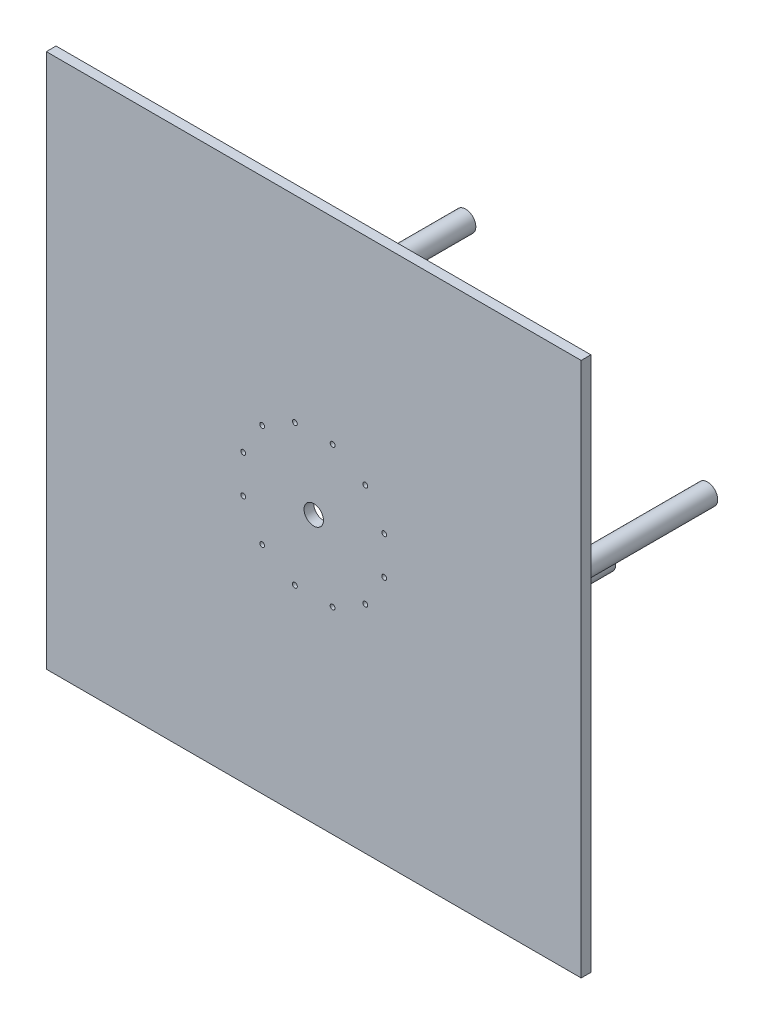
ISO-10303-21;
HEADER;
FILE_DESCRIPTION(('STEP AP214'),'2;1');
FILE_NAME('part.step','',(''),(''),'','','');
FILE_SCHEMA(('AUTOMOTIVE_DESIGN { 1 0 10303 214 1 1 1 1 }'));
ENDSEC;
DATA;
#1=APPLICATION_CONTEXT('core data for automotive mechanical design processes');
#2=APPLICATION_PROTOCOL_DEFINITION('international standard','automotive_design',2000,#1);
#3=PRODUCT_CONTEXT('',#1,'mechanical');
#4=PRODUCT('Part','Part','',(#3));
#5=PRODUCT_RELATED_PRODUCT_CATEGORY('part','',(#4));
#6=PRODUCT_DEFINITION_FORMATION('','',#4);
#7=PRODUCT_DEFINITION_CONTEXT('part definition',#1,'design');
#8=PRODUCT_DEFINITION('design','',#6,#7);
#9=PRODUCT_DEFINITION_SHAPE('','',#8);
#10=(LENGTH_UNIT() NAMED_UNIT(*) SI_UNIT(.MILLI.,.METRE.));
#11=(NAMED_UNIT(*) PLANE_ANGLE_UNIT() SI_UNIT($,.RADIAN.));
#12=(NAMED_UNIT(*) SI_UNIT($,.STERADIAN.) SOLID_ANGLE_UNIT());
#13=UNCERTAINTY_MEASURE_WITH_UNIT(LENGTH_MEASURE(1.E-05),#10,'distance_accuracy_value','');
#14=(GEOMETRIC_REPRESENTATION_CONTEXT(3) GLOBAL_UNCERTAINTY_ASSIGNED_CONTEXT((#13)) GLOBAL_UNIT_ASSIGNED_CONTEXT((#10,
#11,#12)) REPRESENTATION_CONTEXT('',''));
#15=CARTESIAN_POINT('',(0.,0.,0.));
#16=DIRECTION('',(0.,0.,1.));
#17=DIRECTION('',(1.,0.,0.));
#18=AXIS2_PLACEMENT_3D('',#15,#16,#17);
#19=CARTESIAN_POINT('',(0.,1100.,0.));
#20=DIRECTION('',(0.,0.,-1.));
#21=DIRECTION('',(-1.,0.,0.));
#22=AXIS2_PLACEMENT_3D('',#19,#20,#21);
#23=PLANE('',#22);
#24=CARTESIAN_POINT('',(656.066017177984,656.066017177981,0.));
#25=DIRECTION('',(0.,0.,-1.));
#26=DIRECTION('',(-0.866025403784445,-0.499999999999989,0.));
#27=AXIS2_PLACEMENT_3D('',#24,#25,#26);
#28=CIRCLE('',#27,5.00000000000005);
#29=CARTESIAN_POINT('',(651.735890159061,653.566017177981,0.));
#30=VERTEX_POINT('',#29);
#31=EDGE_CURVE('E263',#30,#30,#28,.T.);
#32=ORIENTED_EDGE('',*,*,#31,.F.);
#33=EDGE_LOOP('',(#32));
#34=FACE_BOUND('',#33,.T.);
#35=CARTESIAN_POINT('',(588.82285676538,694.88887394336,0.));
#36=DIRECTION('',(0.,0.,-1.));
#37=DIRECTION('',(-0.50000000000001,-0.866025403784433,0.));
#38=AXIS2_PLACEMENT_3D('',#35,#36,#37);
#39=CIRCLE('',#38,5.00000000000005);
#40=CARTESIAN_POINT('',(586.32285676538,690.558746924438,0.));
#41=VERTEX_POINT('',#40);
#42=EDGE_CURVE('E257',#41,#41,#39,.T.);
#43=ORIENTED_EDGE('',*,*,#42,.F.);
#44=EDGE_LOOP('',(#43));
#45=FACE_BOUND('',#44,.T.);
#46=CARTESIAN_POINT('',(511.177143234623,694.888873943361,0.));
#47=DIRECTION('',(0.,0.,-1.));
#48=DIRECTION('',(0.,-1.,0.));
#49=AXIS2_PLACEMENT_3D('',#46,#47,#48);
#50=CIRCLE('',#49,5.00000000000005);
#51=CARTESIAN_POINT('',(511.177143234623,689.888873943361,0.));
#52=VERTEX_POINT('',#51);
#53=EDGE_CURVE('E251',#52,#52,#50,.T.);
#54=ORIENTED_EDGE('',*,*,#53,.F.);
#55=EDGE_LOOP('',(#54));
#56=FACE_BOUND('',#55,.T.);
#57=CARTESIAN_POINT('',(443.933982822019,656.066017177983,0.));
#58=DIRECTION('',(0.,0.,-1.));
#59=DIRECTION('',(0.499999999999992,-0.866025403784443,0.));
#60=AXIS2_PLACEMENT_3D('',#57,#58,#59);
#61=CIRCLE('',#60,5.00000000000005);
#62=CARTESIAN_POINT('',(446.433982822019,651.735890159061,0.));
#63=VERTEX_POINT('',#62);
#64=EDGE_CURVE('E245',#63,#63,#61,.T.);
#65=ORIENTED_EDGE('',*,*,#64,.F.);
#66=EDGE_LOOP('',(#65));
#67=FACE_BOUND('',#66,.T.);
#68=CARTESIAN_POINT('',(405.11112605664,588.822856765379,0.));
#69=DIRECTION('',(0.,0.,-1.));
#70=DIRECTION('',(0.866025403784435,-0.500000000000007,0.));
#71=AXIS2_PLACEMENT_3D('',#68,#69,#70);
#72=CIRCLE('',#71,5.00000000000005);
#73=CARTESIAN_POINT('',(409.441253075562,586.322856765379,0.));
#74=VERTEX_POINT('',#73);
#75=EDGE_CURVE('E239',#74,#74,#72,.T.);
#76=ORIENTED_EDGE('',*,*,#75,.F.);
#77=EDGE_LOOP('',(#76));
#78=FACE_BOUND('',#77,.T.);
#79=CARTESIAN_POINT('',(405.11112605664,511.177143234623,0.));
#80=DIRECTION('',(0.,0.,-1.));
#81=DIRECTION('',(1.,0.,0.));
#82=AXIS2_PLACEMENT_3D('',#79,#80,#81);
#83=CIRCLE('',#82,5.00000000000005);
#84=CARTESIAN_POINT('',(410.11112605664,511.177143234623,0.));
#85=VERTEX_POINT('',#84);
#86=EDGE_CURVE('E233',#85,#85,#83,.T.);
#87=ORIENTED_EDGE('',*,*,#86,.F.);
#88=EDGE_LOOP('',(#87));
#89=FACE_BOUND('',#88,.T.);
#90=CARTESIAN_POINT('',(443.933982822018,443.933982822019,0.));
#91=DIRECTION('',(0.,0.,-1.));
#92=DIRECTION('',(0.866025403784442,0.499999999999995,0.));
#93=AXIS2_PLACEMENT_3D('',#90,#91,#92);
#94=CIRCLE('',#93,5.00000000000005);
#95=CARTESIAN_POINT('',(448.26410984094,446.433982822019,0.));
#96=VERTEX_POINT('',#95);
#97=EDGE_CURVE('E227',#96,#96,#94,.T.);
#98=ORIENTED_EDGE('',*,*,#97,.F.);
#99=EDGE_LOOP('',(#98));
#100=FACE_BOUND('',#99,.T.);
#101=CARTESIAN_POINT('',(511.177143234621,405.11112605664,0.));
#102=DIRECTION('',(0.,0.,-1.));
#103=DIRECTION('',(0.500000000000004,0.866025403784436,0.));
#104=AXIS2_PLACEMENT_3D('',#101,#102,#103);
#105=CIRCLE('',#104,5.00000000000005);
#106=CARTESIAN_POINT('',(513.677143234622,409.441253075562,0.));
#107=VERTEX_POINT('',#106);
#108=EDGE_CURVE('E221',#107,#107,#105,.T.);
#109=ORIENTED_EDGE('',*,*,#108,.F.);
#110=EDGE_LOOP('',(#109));
#111=FACE_BOUND('',#110,.T.);
#112=CARTESIAN_POINT('',(588.822856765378,405.11112605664,0.));
#113=DIRECTION('',(0.,0.,-1.));
#114=DIRECTION('',(0.,1.,0.));
#115=AXIS2_PLACEMENT_3D('',#112,#113,#114);
#116=CIRCLE('',#115,5.00000000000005);
#117=CARTESIAN_POINT('',(588.822856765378,410.11112605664,0.));
#118=VERTEX_POINT('',#117);
#119=EDGE_CURVE('E215',#118,#118,#116,.T.);
#120=ORIENTED_EDGE('',*,*,#119,.F.);
#121=EDGE_LOOP('',(#120));
#122=FACE_BOUND('',#121,.T.);
#123=CARTESIAN_POINT('',(656.066017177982,443.933982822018,0.));
#124=DIRECTION('',(0.,0.,-1.));
#125=DIRECTION('',(-0.499999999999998,0.86602540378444,0.));
#126=AXIS2_PLACEMENT_3D('',#123,#124,#125);
#127=CIRCLE('',#126,5.00000000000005);
#128=CARTESIAN_POINT('',(653.566017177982,448.26410984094,0.));
#129=VERTEX_POINT('',#128);
#130=EDGE_CURVE('E209',#129,#129,#127,.T.);
#131=ORIENTED_EDGE('',*,*,#130,.F.);
#132=EDGE_LOOP('',(#131));
#133=FACE_BOUND('',#132,.T.);
#134=CARTESIAN_POINT('',(694.88887394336,511.177143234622,0.));
#135=DIRECTION('',(0.,0.,-1.));
#136=DIRECTION('',(-0.866025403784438,0.500000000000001,0.));
#137=AXIS2_PLACEMENT_3D('',#134,#135,#136);
#138=CIRCLE('',#137,5.00000000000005);
#139=CARTESIAN_POINT('',(690.558746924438,513.677143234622,0.));
#140=VERTEX_POINT('',#139);
#141=EDGE_CURVE('E203',#140,#140,#138,.T.);
#142=ORIENTED_EDGE('',*,*,#141,.F.);
#143=EDGE_LOOP('',(#142));
#144=FACE_BOUND('',#143,.T.);
#145=CARTESIAN_POINT('',(694.88887394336,588.822856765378,0.));
#146=DIRECTION('',(0.,0.,-1.));
#147=DIRECTION('',(-1.,0.,0.));
#148=AXIS2_PLACEMENT_3D('',#145,#146,#147);
#149=CIRCLE('',#148,5.00000000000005);
#150=CARTESIAN_POINT('',(689.88887394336,588.822856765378,0.));
#151=VERTEX_POINT('',#150);
#152=EDGE_CURVE('E197',#151,#151,#149,.T.);
#153=ORIENTED_EDGE('',*,*,#152,.F.);
#154=EDGE_LOOP('',(#153));
#155=FACE_BOUND('',#154,.T.);
#156=CARTESIAN_POINT('',(550.,550.,0.));
#157=DIRECTION('',(0.,0.,-1.));
#158=DIRECTION('',(-1.,0.,0.));
#159=AXIS2_PLACEMENT_3D('',#156,#157,#158);
#160=CIRCLE('',#159,20.0000000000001);
#161=CARTESIAN_POINT('',(530.,550.,0.));
#162=VERTEX_POINT('',#161);
#163=EDGE_CURVE('E189',#162,#162,#160,.T.);
#164=ORIENTED_EDGE('',*,*,#163,.F.);
#165=EDGE_LOOP('',(#164));
#166=FACE_BOUND('',#165,.T.);
#167=DIRECTION('',(0.,-1.,0.));
#168=VECTOR('',#167,1.);
#169=CARTESIAN_POINT('',(0.,0.,0.));
#170=LINE('',#169,#168);
#171=CARTESIAN_POINT('',(0.,1100.,0.));
#172=VERTEX_POINT('',#171);
#173=CARTESIAN_POINT('',(0.,0.,0.));
#174=VERTEX_POINT('',#173);
#175=EDGE_CURVE('E70',#172,#174,#170,.T.);
#176=ORIENTED_EDGE('',*,*,#175,.F.);
#177=DIRECTION('',(-1.,0.,0.));
#178=VECTOR('',#177,1.);
#179=CARTESIAN_POINT('',(0.,1100.,0.));
#180=LINE('',#179,#178);
#181=CARTESIAN_POINT('',(1100.,1100.,0.));
#182=VERTEX_POINT('',#181);
#183=EDGE_CURVE('E95',#182,#172,#180,.T.);
#184=ORIENTED_EDGE('',*,*,#183,.F.);
#185=DIRECTION('',(0.,1.,0.));
#186=VECTOR('',#185,1.);
#187=CARTESIAN_POINT('',(1100.,0.,0.));
#188=LINE('',#187,#186);
#189=CARTESIAN_POINT('',(1100.,0.,0.));
#190=VERTEX_POINT('',#189);
#191=EDGE_CURVE('E71',#190,#182,#188,.T.);
#192=ORIENTED_EDGE('',*,*,#191,.F.);
#193=DIRECTION('',(1.,0.,0.));
#194=VECTOR('',#193,1.);
#195=CARTESIAN_POINT('',(0.,0.,0.));
#196=LINE('',#195,#194);
#197=EDGE_CURVE('E65',#174,#190,#196,.T.);
#198=ORIENTED_EDGE('',*,*,#197,.F.);
#199=EDGE_LOOP('',(#176,#184,#192,#198));
#200=FACE_BOUND('',#199,.T.);
#201=CARTESIAN_POINT('',(268.092213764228,652.606042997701,0.));
#202=DIRECTION('',(0.,0.,-1.));
#203=DIRECTION('',(-1.,0.,0.));
#204=AXIS2_PLACEMENT_3D('',#201,#202,#203);
#205=CIRCLE('',#204,21.);
#206=CARTESIAN_POINT('',(247.092213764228,652.606042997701,0.));
#207=VERTEX_POINT('',#206);
#208=EDGE_CURVE('E90',#207,#207,#205,.T.);
#209=ORIENTED_EDGE('',*,*,#208,.F.);
#210=EDGE_LOOP('',(#209));
#211=FACE_BOUND('',#210,.T.);
#212=CARTESIAN_POINT('',(839.777747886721,472.354286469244,0.));
#213=DIRECTION('',(0.,0.,-1.));
#214=DIRECTION('',(-1.,0.,0.));
#215=AXIS2_PLACEMENT_3D('',#212,#213,#214);
#216=CIRCLE('',#215,21.);
#217=CARTESIAN_POINT('',(818.77774788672,472.354286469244,0.));
#218=VERTEX_POINT('',#217);
#219=EDGE_CURVE('E269',#218,#218,#216,.T.);
#220=ORIENTED_EDGE('',*,*,#219,.F.);
#221=EDGE_LOOP('',(#220));
#222=FACE_BOUND('',#221,.T.);
#223=CARTESIAN_POINT('',(629.975084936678,251.528919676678,0.));
#224=DIRECTION('',(0.,0.,-1.));
#225=DIRECTION('',(-1.,0.,0.));
#226=AXIS2_PLACEMENT_3D('',#223,#224,#225);
#227=CIRCLE('',#226,21.);
#228=CARTESIAN_POINT('',(608.975084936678,251.528919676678,0.));
#229=VERTEX_POINT('',#228);
#230=EDGE_CURVE('E278',#229,#229,#227,.T.);
#231=ORIENTED_EDGE('',*,*,#230,.F.);
#232=EDGE_LOOP('',(#231));
#233=FACE_BOUND('',#232,.T.);
#234=CARTESIAN_POINT('',(472.354286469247,839.777747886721,0.));
#235=DIRECTION('',(0.,0.,-1.));
#236=DIRECTION('',(-1.,0.,0.));
#237=AXIS2_PLACEMENT_3D('',#234,#235,#236);
#238=CIRCLE('',#237,21.);
#239=CARTESIAN_POINT('',(451.354286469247,839.777747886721,0.));
#240=VERTEX_POINT('',#239);
#241=EDGE_CURVE('E287',#240,#240,#238,.T.);
#242=ORIENTED_EDGE('',*,*,#241,.F.);
#243=EDGE_LOOP('',(#242));
#244=FACE_BOUND('',#243,.T.);
#245=ADVANCED_FACE('F24',(#34,#45,#56,#67,#78,#89,#100,#111,#122,#133,#144,#155,#166,#200,#211,
#222,#233,#244),#23,.T.);
#246=CARTESIAN_POINT('',(0.,0.,20.));
#247=DIRECTION('',(1.,0.,0.));
#248=DIRECTION('',(0.,0.,-1.));
#249=AXIS2_PLACEMENT_3D('',#246,#247,#248);
#250=PLANE('',#249);
#251=ORIENTED_EDGE('',*,*,#175,.T.);
#252=DIRECTION('',(0.,0.,-1.));
#253=VECTOR('',#252,1.);
#254=CARTESIAN_POINT('',(0.,0.,20.));
#255=LINE('',#254,#253);
#256=CARTESIAN_POINT('',(0.,0.,20.));
#257=VERTEX_POINT('',#256);
#258=EDGE_CURVE('E77',#257,#174,#255,.T.);
#259=ORIENTED_EDGE('',*,*,#258,.F.);
#260=DIRECTION('',(0.,-1.,0.));
#261=VECTOR('',#260,1.);
#262=CARTESIAN_POINT('',(0.,0.,20.));
#263=LINE('',#262,#261);
#264=CARTESIAN_POINT('',(0.,1100.,20.));
#265=VERTEX_POINT('',#264);
#266=EDGE_CURVE('E97',#265,#257,#263,.T.);
#267=ORIENTED_EDGE('',*,*,#266,.F.);
#268=DIRECTION('',(0.,0.,-1.));
#269=VECTOR('',#268,1.);
#270=CARTESIAN_POINT('',(0.,1100.,20.));
#271=LINE('',#270,#269);
#272=EDGE_CURVE('E86',#265,#172,#271,.T.);
#273=ORIENTED_EDGE('',*,*,#272,.T.);
#274=EDGE_LOOP('',(#251,#259,#267,#273));
#275=FACE_BOUND('',#274,.T.);
#276=ADVANCED_FACE('F26',(#275),#250,.F.);
#277=CARTESIAN_POINT('',(0.,0.,20.));
#278=DIRECTION('',(0.,1.,0.));
#279=DIRECTION('',(0.,0.,1.));
#280=AXIS2_PLACEMENT_3D('',#277,#278,#279);
#281=PLANE('',#280);
#282=ORIENTED_EDGE('',*,*,#197,.T.);
#283=DIRECTION('',(0.,0.,-1.));
#284=VECTOR('',#283,1.);
#285=CARTESIAN_POINT('',(1100.,0.,20.));
#286=LINE('',#285,#284);
#287=CARTESIAN_POINT('',(1100.,0.,20.));
#288=VERTEX_POINT('',#287);
#289=EDGE_CURVE('E83',#288,#190,#286,.T.);
#290=ORIENTED_EDGE('',*,*,#289,.F.);
#291=DIRECTION('',(1.,0.,0.));
#292=VECTOR('',#291,1.);
#293=CARTESIAN_POINT('',(0.,0.,20.));
#294=LINE('',#293,#292);
#295=EDGE_CURVE('E79',#257,#288,#294,.T.);
#296=ORIENTED_EDGE('',*,*,#295,.F.);
#297=ORIENTED_EDGE('',*,*,#258,.T.);
#298=EDGE_LOOP('',(#282,#290,#296,#297));
#299=FACE_BOUND('',#298,.T.);
#300=ADVANCED_FACE('F78',(#299),#281,.F.);
#301=CARTESIAN_POINT('',(1100.,0.,20.));
#302=DIRECTION('',(-1.,0.,0.));
#303=DIRECTION('',(0.,0.,1.));
#304=AXIS2_PLACEMENT_3D('',#301,#302,#303);
#305=PLANE('',#304);
#306=ORIENTED_EDGE('',*,*,#191,.T.);
#307=DIRECTION('',(0.,0.,-1.));
#308=VECTOR('',#307,1.);
#309=CARTESIAN_POINT('',(1100.,1100.,20.));
#310=LINE('',#309,#308);
#311=CARTESIAN_POINT('',(1100.,1100.,20.));
#312=VERTEX_POINT('',#311);
#313=EDGE_CURVE('E103',#312,#182,#310,.T.);
#314=ORIENTED_EDGE('',*,*,#313,.F.);
#315=DIRECTION('',(0.,1.,0.));
#316=VECTOR('',#315,1.);
#317=CARTESIAN_POINT('',(1100.,0.,20.));
#318=LINE('',#317,#316);
#319=EDGE_CURVE('E44',#288,#312,#318,.T.);
#320=ORIENTED_EDGE('',*,*,#319,.F.);
#321=ORIENTED_EDGE('',*,*,#289,.T.);
#322=EDGE_LOOP('',(#306,#314,#320,#321));
#323=FACE_BOUND('',#322,.T.);
#324=ADVANCED_FACE('F380',(#323),#305,.F.);
#325=CARTESIAN_POINT('',(0.,1100.,20.));
#326=DIRECTION('',(0.,-1.,0.));
#327=DIRECTION('',(0.,0.,-1.));
#328=AXIS2_PLACEMENT_3D('',#325,#326,#327);
#329=PLANE('',#328);
#330=ORIENTED_EDGE('',*,*,#183,.T.);
#331=ORIENTED_EDGE('',*,*,#272,.F.);
#332=DIRECTION('',(-1.,0.,0.));
#333=VECTOR('',#332,1.);
#334=CARTESIAN_POINT('',(0.,1100.,20.));
#335=LINE('',#334,#333);
#336=EDGE_CURVE('E39',#312,#265,#335,.T.);
#337=ORIENTED_EDGE('',*,*,#336,.F.);
#338=ORIENTED_EDGE('',*,*,#313,.T.);
#339=EDGE_LOOP('',(#330,#331,#337,#338));
#340=FACE_BOUND('',#339,.T.);
#341=ADVANCED_FACE('F179',(#340),#329,.F.);
#342=CARTESIAN_POINT('',(0.,1100.,20.));
#343=DIRECTION('',(0.,0.,-1.));
#344=DIRECTION('',(-1.,0.,0.));
#345=AXIS2_PLACEMENT_3D('',#342,#343,#344);
#346=PLANE('',#345);
#347=CARTESIAN_POINT('',(656.066017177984,656.066017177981,20.));
#348=DIRECTION('',(0.,0.,-1.));
#349=DIRECTION('',(-0.866025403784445,-0.499999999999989,0.));
#350=AXIS2_PLACEMENT_3D('',#347,#348,#349);
#351=CIRCLE('',#350,5.00000000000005);
#352=CARTESIAN_POINT('',(651.735890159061,653.566017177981,20.));
#353=VERTEX_POINT('',#352);
#354=EDGE_CURVE('E260',#353,#353,#351,.T.);
#355=ORIENTED_EDGE('',*,*,#354,.T.);
#356=EDGE_LOOP('',(#355));
#357=FACE_BOUND('',#356,.T.);
#358=CARTESIAN_POINT('',(588.82285676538,694.88887394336,20.));
#359=DIRECTION('',(0.,0.,-1.));
#360=DIRECTION('',(-0.50000000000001,-0.866025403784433,0.));
#361=AXIS2_PLACEMENT_3D('',#358,#359,#360);
#362=CIRCLE('',#361,5.00000000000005);
#363=CARTESIAN_POINT('',(586.32285676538,690.558746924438,20.));
#364=VERTEX_POINT('',#363);
#365=EDGE_CURVE('E254',#364,#364,#362,.T.);
#366=ORIENTED_EDGE('',*,*,#365,.T.);
#367=EDGE_LOOP('',(#366));
#368=FACE_BOUND('',#367,.T.);
#369=CARTESIAN_POINT('',(511.177143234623,694.888873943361,20.));
#370=DIRECTION('',(0.,0.,-1.));
#371=DIRECTION('',(0.,-1.,0.));
#372=AXIS2_PLACEMENT_3D('',#369,#370,#371);
#373=CIRCLE('',#372,5.00000000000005);
#374=CARTESIAN_POINT('',(511.177143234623,689.888873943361,20.));
#375=VERTEX_POINT('',#374);
#376=EDGE_CURVE('E248',#375,#375,#373,.T.);
#377=ORIENTED_EDGE('',*,*,#376,.T.);
#378=EDGE_LOOP('',(#377));
#379=FACE_BOUND('',#378,.T.);
#380=CARTESIAN_POINT('',(443.933982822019,656.066017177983,20.));
#381=DIRECTION('',(0.,0.,-1.));
#382=DIRECTION('',(0.499999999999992,-0.866025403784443,0.));
#383=AXIS2_PLACEMENT_3D('',#380,#381,#382);
#384=CIRCLE('',#383,5.00000000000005);
#385=CARTESIAN_POINT('',(446.433982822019,651.735890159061,20.));
#386=VERTEX_POINT('',#385);
#387=EDGE_CURVE('E242',#386,#386,#384,.T.);
#388=ORIENTED_EDGE('',*,*,#387,.T.);
#389=EDGE_LOOP('',(#388));
#390=FACE_BOUND('',#389,.T.);
#391=CARTESIAN_POINT('',(405.11112605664,588.822856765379,20.));
#392=DIRECTION('',(0.,0.,-1.));
#393=DIRECTION('',(0.866025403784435,-0.500000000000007,0.));
#394=AXIS2_PLACEMENT_3D('',#391,#392,#393);
#395=CIRCLE('',#394,5.00000000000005);
#396=CARTESIAN_POINT('',(409.441253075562,586.322856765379,20.));
#397=VERTEX_POINT('',#396);
#398=EDGE_CURVE('E236',#397,#397,#395,.T.);
#399=ORIENTED_EDGE('',*,*,#398,.T.);
#400=EDGE_LOOP('',(#399));
#401=FACE_BOUND('',#400,.T.);
#402=CARTESIAN_POINT('',(405.11112605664,511.177143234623,20.));
#403=DIRECTION('',(0.,0.,-1.));
#404=DIRECTION('',(1.,0.,0.));
#405=AXIS2_PLACEMENT_3D('',#402,#403,#404);
#406=CIRCLE('',#405,5.00000000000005);
#407=CARTESIAN_POINT('',(410.11112605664,511.177143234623,20.));
#408=VERTEX_POINT('',#407);
#409=EDGE_CURVE('E230',#408,#408,#406,.T.);
#410=ORIENTED_EDGE('',*,*,#409,.T.);
#411=EDGE_LOOP('',(#410));
#412=FACE_BOUND('',#411,.T.);
#413=CARTESIAN_POINT('',(443.933982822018,443.933982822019,20.));
#414=DIRECTION('',(0.,0.,-1.));
#415=DIRECTION('',(0.866025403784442,0.499999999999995,0.));
#416=AXIS2_PLACEMENT_3D('',#413,#414,#415);
#417=CIRCLE('',#416,5.00000000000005);
#418=CARTESIAN_POINT('',(448.26410984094,446.433982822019,20.));
#419=VERTEX_POINT('',#418);
#420=EDGE_CURVE('E224',#419,#419,#417,.T.);
#421=ORIENTED_EDGE('',*,*,#420,.T.);
#422=EDGE_LOOP('',(#421));
#423=FACE_BOUND('',#422,.T.);
#424=CARTESIAN_POINT('',(511.177143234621,405.11112605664,20.));
#425=DIRECTION('',(0.,0.,-1.));
#426=DIRECTION('',(0.500000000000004,0.866025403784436,0.));
#427=AXIS2_PLACEMENT_3D('',#424,#425,#426);
#428=CIRCLE('',#427,5.00000000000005);
#429=CARTESIAN_POINT('',(513.677143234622,409.441253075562,20.));
#430=VERTEX_POINT('',#429);
#431=EDGE_CURVE('E218',#430,#430,#428,.T.);
#432=ORIENTED_EDGE('',*,*,#431,.T.);
#433=EDGE_LOOP('',(#432));
#434=FACE_BOUND('',#433,.T.);
#435=CARTESIAN_POINT('',(588.822856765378,405.11112605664,20.));
#436=DIRECTION('',(0.,0.,-1.));
#437=DIRECTION('',(0.,1.,0.));
#438=AXIS2_PLACEMENT_3D('',#435,#436,#437);
#439=CIRCLE('',#438,5.00000000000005);
#440=CARTESIAN_POINT('',(588.822856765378,410.11112605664,20.));
#441=VERTEX_POINT('',#440);
#442=EDGE_CURVE('E212',#441,#441,#439,.T.);
#443=ORIENTED_EDGE('',*,*,#442,.T.);
#444=EDGE_LOOP('',(#443));
#445=FACE_BOUND('',#444,.T.);
#446=CARTESIAN_POINT('',(656.066017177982,443.933982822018,20.));
#447=DIRECTION('',(0.,0.,-1.));
#448=DIRECTION('',(-0.499999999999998,0.86602540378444,0.));
#449=AXIS2_PLACEMENT_3D('',#446,#447,#448);
#450=CIRCLE('',#449,5.00000000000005);
#451=CARTESIAN_POINT('',(653.566017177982,448.26410984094,20.));
#452=VERTEX_POINT('',#451);
#453=EDGE_CURVE('E206',#452,#452,#450,.T.);
#454=ORIENTED_EDGE('',*,*,#453,.T.);
#455=EDGE_LOOP('',(#454));
#456=FACE_BOUND('',#455,.T.);
#457=CARTESIAN_POINT('',(694.88887394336,511.177143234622,20.));
#458=DIRECTION('',(0.,0.,-1.));
#459=DIRECTION('',(-0.866025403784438,0.500000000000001,0.));
#460=AXIS2_PLACEMENT_3D('',#457,#458,#459);
#461=CIRCLE('',#460,5.00000000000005);
#462=CARTESIAN_POINT('',(690.558746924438,513.677143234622,20.));
#463=VERTEX_POINT('',#462);
#464=EDGE_CURVE('E200',#463,#463,#461,.T.);
#465=ORIENTED_EDGE('',*,*,#464,.T.);
#466=EDGE_LOOP('',(#465));
#467=FACE_BOUND('',#466,.T.);
#468=CARTESIAN_POINT('',(694.88887394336,588.822856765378,20.));
#469=DIRECTION('',(0.,0.,-1.));
#470=DIRECTION('',(-1.,0.,0.));
#471=AXIS2_PLACEMENT_3D('',#468,#469,#470);
#472=CIRCLE('',#471,5.00000000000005);
#473=CARTESIAN_POINT('',(689.88887394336,588.822856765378,20.));
#474=VERTEX_POINT('',#473);
#475=EDGE_CURVE('E194',#474,#474,#472,.T.);
#476=ORIENTED_EDGE('',*,*,#475,.T.);
#477=EDGE_LOOP('',(#476));
#478=FACE_BOUND('',#477,.T.);
#479=CARTESIAN_POINT('',(550.,550.,20.));
#480=DIRECTION('',(0.,0.,-1.));
#481=DIRECTION('',(-1.,0.,0.));
#482=AXIS2_PLACEMENT_3D('',#479,#480,#481);
#483=CIRCLE('',#482,20.0000000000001);
#484=CARTESIAN_POINT('',(530.,550.,20.));
#485=VERTEX_POINT('',#484);
#486=EDGE_CURVE('E185',#485,#485,#483,.T.);
#487=ORIENTED_EDGE('',*,*,#486,.T.);
#488=EDGE_LOOP('',(#487));
#489=FACE_BOUND('',#488,.T.);
#490=ORIENTED_EDGE('',*,*,#266,.T.);
#491=ORIENTED_EDGE('',*,*,#295,.T.);
#492=ORIENTED_EDGE('',*,*,#319,.T.);
#493=ORIENTED_EDGE('',*,*,#336,.T.);
#494=EDGE_LOOP('',(#490,#491,#492,#493));
#495=FACE_BOUND('',#494,.T.);
#496=ADVANCED_FACE('F174',(#357,#368,#379,#390,#401,#412,#423,#434,#445,#456,#467,#478,#489,
#495),#346,.F.);
#497=CARTESIAN_POINT('',(268.092213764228,652.606042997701,-300.));
#498=DIRECTION('',(0.,0.,-1.));
#499=DIRECTION('',(-1.,0.,0.));
#500=AXIS2_PLACEMENT_3D('',#497,#498,#499);
#501=PLANE('',#500);
#502=CARTESIAN_POINT('',(268.092213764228,652.606042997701,-300.));
#503=DIRECTION('',(0.,0.,-1.));
#504=DIRECTION('',(-1.,0.,0.));
#505=AXIS2_PLACEMENT_3D('',#502,#503,#504);
#506=CIRCLE('',#505,21.);
#507=CARTESIAN_POINT('',(247.092213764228,652.606042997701,-300.));
#508=VERTEX_POINT('',#507);
#509=EDGE_CURVE('E87',#508,#508,#506,.T.);
#510=ORIENTED_EDGE('',*,*,#509,.T.);
#511=EDGE_LOOP('',(#510));
#512=FACE_BOUND('',#511,.T.);
#513=CARTESIAN_POINT('',(268.092213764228,652.606042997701,-300.));
#514=DIRECTION('',(0.,0.,-1.));
#515=DIRECTION('',(-1.,0.,0.));
#516=AXIS2_PLACEMENT_3D('',#513,#514,#515);
#517=CIRCLE('',#516,19.);
#518=CARTESIAN_POINT('',(249.092213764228,652.606042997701,-300.));
#519=VERTEX_POINT('',#518);
#520=EDGE_CURVE('E184',#519,#519,#517,.T.);
#521=ORIENTED_EDGE('',*,*,#520,.F.);
#522=EDGE_LOOP('',(#521));
#523=FACE_BOUND('',#522,.T.);
#524=ADVANCED_FACE('F168',(#512,#523),#501,.T.);
#525=CARTESIAN_POINT('',(268.092213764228,652.606042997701,-300.));
#526=DIRECTION('',(0.,0.,1.));
#527=DIRECTION('',(1.,0.,0.));
#528=AXIS2_PLACEMENT_3D('',#525,#526,#527);
#529=CYLINDRICAL_SURFACE('',#528,21.);
#530=ORIENTED_EDGE('',*,*,#509,.F.);
#531=EDGE_LOOP('',(#530));
#532=FACE_BOUND('',#531,.T.);
#533=ORIENTED_EDGE('',*,*,#208,.T.);
#534=EDGE_LOOP('',(#533));
#535=FACE_BOUND('',#534,.T.);
#536=ADVANCED_FACE('F160',(#532,#535),#529,.T.);
#537=CARTESIAN_POINT('',(268.092213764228,652.606042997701,-300.));
#538=DIRECTION('',(0.,0.,1.));
#539=DIRECTION('',(1.,0.,0.));
#540=AXIS2_PLACEMENT_3D('',#537,#538,#539);
#541=CYLINDRICAL_SURFACE('',#540,19.);
#542=ORIENTED_EDGE('',*,*,#520,.T.);
#543=EDGE_LOOP('',(#542));
#544=FACE_BOUND('',#543,.T.);
#545=CARTESIAN_POINT('',(268.092213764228,652.606042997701,0.));
#546=DIRECTION('',(0.,0.,-1.));
#547=DIRECTION('',(-1.,0.,0.));
#548=AXIS2_PLACEMENT_3D('',#545,#546,#547);
#549=CIRCLE('',#548,19.);
#550=CARTESIAN_POINT('',(249.092213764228,652.606042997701,0.));
#551=VERTEX_POINT('',#550);
#552=EDGE_CURVE('E82',#551,#551,#549,.F.);
#553=ORIENTED_EDGE('',*,*,#552,.T.);
#554=EDGE_LOOP('',(#553));
#555=FACE_BOUND('',#554,.T.);
#556=ADVANCED_FACE('F151',(#544,#555),#541,.F.);
#557=ORIENTED_EDGE('',*,*,#552,.F.);
#558=EDGE_LOOP('',(#557));
#559=FACE_BOUND('',#558,.T.);
#560=ADVANCED_FACE('F132',(#559),#23,.T.);
#561=CARTESIAN_POINT('',(550.,550.,20.));
#562=DIRECTION('',(0.,0.,-1.));
#563=DIRECTION('',(-1.,0.,0.));
#564=AXIS2_PLACEMENT_3D('',#561,#562,#563);
#565=CYLINDRICAL_SURFACE('',#564,20.0000000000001);
#566=ORIENTED_EDGE('',*,*,#486,.F.);
#567=EDGE_LOOP('',(#566));
#568=FACE_BOUND('',#567,.T.);
#569=ORIENTED_EDGE('',*,*,#163,.T.);
#570=EDGE_LOOP('',(#569));
#571=FACE_BOUND('',#570,.T.);
#572=ADVANCED_FACE('F150',(#568,#571),#565,.F.);
#573=CARTESIAN_POINT('',(694.88887394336,588.822856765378,20.));
#574=DIRECTION('',(0.,0.,-1.));
#575=DIRECTION('',(-1.,0.,0.));
#576=AXIS2_PLACEMENT_3D('',#573,#574,#575);
#577=CYLINDRICAL_SURFACE('',#576,5.00000000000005);
#578=ORIENTED_EDGE('',*,*,#475,.F.);
#579=EDGE_LOOP('',(#578));
#580=FACE_BOUND('',#579,.T.);
#581=ORIENTED_EDGE('',*,*,#152,.T.);
#582=EDGE_LOOP('',(#581));
#583=FACE_BOUND('',#582,.T.);
#584=ADVANCED_FACE('F157',(#580,#583),#577,.F.);
#585=CARTESIAN_POINT('',(694.88887394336,511.177143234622,20.));
#586=DIRECTION('',(0.,0.,-1.));
#587=DIRECTION('',(-1.,0.,0.));
#588=AXIS2_PLACEMENT_3D('',#585,#586,#587);
#589=CYLINDRICAL_SURFACE('',#588,5.00000000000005);
#590=ORIENTED_EDGE('',*,*,#464,.F.);
#591=EDGE_LOOP('',(#590));
#592=FACE_BOUND('',#591,.T.);
#593=ORIENTED_EDGE('',*,*,#141,.T.);
#594=EDGE_LOOP('',(#593));
#595=FACE_BOUND('',#594,.T.);
#596=ADVANCED_FACE('F361',(#592,#595),#589,.F.);
#597=CARTESIAN_POINT('',(656.066017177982,443.933982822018,20.));
#598=DIRECTION('',(0.,0.,-1.));
#599=DIRECTION('',(-1.,0.,0.));
#600=AXIS2_PLACEMENT_3D('',#597,#598,#599);
#601=CYLINDRICAL_SURFACE('',#600,5.00000000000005);
#602=ORIENTED_EDGE('',*,*,#453,.F.);
#603=EDGE_LOOP('',(#602));
#604=FACE_BOUND('',#603,.T.);
#605=ORIENTED_EDGE('',*,*,#130,.T.);
#606=EDGE_LOOP('',(#605));
#607=FACE_BOUND('',#606,.T.);
#608=ADVANCED_FACE('F357',(#604,#607),#601,.F.);
#609=CARTESIAN_POINT('',(588.822856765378,405.11112605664,20.));
#610=DIRECTION('',(0.,0.,-1.));
#611=DIRECTION('',(-1.,0.,0.));
#612=AXIS2_PLACEMENT_3D('',#609,#610,#611);
#613=CYLINDRICAL_SURFACE('',#612,5.00000000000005);
#614=ORIENTED_EDGE('',*,*,#442,.F.);
#615=EDGE_LOOP('',(#614));
#616=FACE_BOUND('',#615,.T.);
#617=ORIENTED_EDGE('',*,*,#119,.T.);
#618=EDGE_LOOP('',(#617));
#619=FACE_BOUND('',#618,.T.);
#620=ADVANCED_FACE('F353',(#616,#619),#613,.F.);
#621=CARTESIAN_POINT('',(511.177143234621,405.11112605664,20.));
#622=DIRECTION('',(0.,0.,-1.));
#623=DIRECTION('',(-1.,0.,0.));
#624=AXIS2_PLACEMENT_3D('',#621,#622,#623);
#625=CYLINDRICAL_SURFACE('',#624,5.00000000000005);
#626=ORIENTED_EDGE('',*,*,#431,.F.);
#627=EDGE_LOOP('',(#626));
#628=FACE_BOUND('',#627,.T.);
#629=ORIENTED_EDGE('',*,*,#108,.T.);
#630=EDGE_LOOP('',(#629));
#631=FACE_BOUND('',#630,.T.);
#632=ADVANCED_FACE('F349',(#628,#631),#625,.F.);
#633=CARTESIAN_POINT('',(443.933982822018,443.933982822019,20.));
#634=DIRECTION('',(0.,0.,-1.));
#635=DIRECTION('',(-1.,0.,0.));
#636=AXIS2_PLACEMENT_3D('',#633,#634,#635);
#637=CYLINDRICAL_SURFACE('',#636,5.00000000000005);
#638=ORIENTED_EDGE('',*,*,#420,.F.);
#639=EDGE_LOOP('',(#638));
#640=FACE_BOUND('',#639,.T.);
#641=ORIENTED_EDGE('',*,*,#97,.T.);
#642=EDGE_LOOP('',(#641));
#643=FACE_BOUND('',#642,.T.);
#644=ADVANCED_FACE('F345',(#640,#643),#637,.F.);
#645=CARTESIAN_POINT('',(405.11112605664,511.177143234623,20.));
#646=DIRECTION('',(0.,0.,-1.));
#647=DIRECTION('',(-1.,0.,0.));
#648=AXIS2_PLACEMENT_3D('',#645,#646,#647);
#649=CYLINDRICAL_SURFACE('',#648,5.00000000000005);
#650=ORIENTED_EDGE('',*,*,#409,.F.);
#651=EDGE_LOOP('',(#650));
#652=FACE_BOUND('',#651,.T.);
#653=ORIENTED_EDGE('',*,*,#86,.T.);
#654=EDGE_LOOP('',(#653));
#655=FACE_BOUND('',#654,.T.);
#656=ADVANCED_FACE('F341',(#652,#655),#649,.F.);
#657=CARTESIAN_POINT('',(405.11112605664,588.822856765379,20.));
#658=DIRECTION('',(0.,0.,-1.));
#659=DIRECTION('',(-1.,0.,0.));
#660=AXIS2_PLACEMENT_3D('',#657,#658,#659);
#661=CYLINDRICAL_SURFACE('',#660,5.00000000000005);
#662=ORIENTED_EDGE('',*,*,#398,.F.);
#663=EDGE_LOOP('',(#662));
#664=FACE_BOUND('',#663,.T.);
#665=ORIENTED_EDGE('',*,*,#75,.T.);
#666=EDGE_LOOP('',(#665));
#667=FACE_BOUND('',#666,.T.);
#668=ADVANCED_FACE('F337',(#664,#667),#661,.F.);
#669=CARTESIAN_POINT('',(443.933982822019,656.066017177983,20.));
#670=DIRECTION('',(0.,0.,-1.));
#671=DIRECTION('',(-1.,0.,0.));
#672=AXIS2_PLACEMENT_3D('',#669,#670,#671);
#673=CYLINDRICAL_SURFACE('',#672,5.00000000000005);
#674=ORIENTED_EDGE('',*,*,#387,.F.);
#675=EDGE_LOOP('',(#674));
#676=FACE_BOUND('',#675,.T.);
#677=ORIENTED_EDGE('',*,*,#64,.T.);
#678=EDGE_LOOP('',(#677));
#679=FACE_BOUND('',#678,.T.);
#680=ADVANCED_FACE('F333',(#676,#679),#673,.F.);
#681=CARTESIAN_POINT('',(511.177143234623,694.888873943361,20.));
#682=DIRECTION('',(0.,0.,-1.));
#683=DIRECTION('',(-1.,0.,0.));
#684=AXIS2_PLACEMENT_3D('',#681,#682,#683);
#685=CYLINDRICAL_SURFACE('',#684,5.00000000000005);
#686=ORIENTED_EDGE('',*,*,#376,.F.);
#687=EDGE_LOOP('',(#686));
#688=FACE_BOUND('',#687,.T.);
#689=ORIENTED_EDGE('',*,*,#53,.T.);
#690=EDGE_LOOP('',(#689));
#691=FACE_BOUND('',#690,.T.);
#692=ADVANCED_FACE('F329',(#688,#691),#685,.F.);
#693=CARTESIAN_POINT('',(588.82285676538,694.88887394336,20.));
#694=DIRECTION('',(0.,0.,-1.));
#695=DIRECTION('',(-1.,0.,0.));
#696=AXIS2_PLACEMENT_3D('',#693,#694,#695);
#697=CYLINDRICAL_SURFACE('',#696,5.00000000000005);
#698=ORIENTED_EDGE('',*,*,#365,.F.);
#699=EDGE_LOOP('',(#698));
#700=FACE_BOUND('',#699,.T.);
#701=ORIENTED_EDGE('',*,*,#42,.T.);
#702=EDGE_LOOP('',(#701));
#703=FACE_BOUND('',#702,.T.);
#704=ADVANCED_FACE('F325',(#700,#703),#697,.F.);
#705=CARTESIAN_POINT('',(656.066017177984,656.066017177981,20.));
#706=DIRECTION('',(0.,0.,-1.));
#707=DIRECTION('',(-1.,0.,0.));
#708=AXIS2_PLACEMENT_3D('',#705,#706,#707);
#709=CYLINDRICAL_SURFACE('',#708,5.00000000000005);
#710=ORIENTED_EDGE('',*,*,#354,.F.);
#711=EDGE_LOOP('',(#710));
#712=FACE_BOUND('',#711,.T.);
#713=ORIENTED_EDGE('',*,*,#31,.T.);
#714=EDGE_LOOP('',(#713));
#715=FACE_BOUND('',#714,.T.);
#716=ADVANCED_FACE('F318',(#712,#715),#709,.F.);
#717=CARTESIAN_POINT('',(839.777747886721,472.354286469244,-500.));
#718=DIRECTION('',(0.,0.,-1.));
#719=DIRECTION('',(-1.,0.,0.));
#720=AXIS2_PLACEMENT_3D('',#717,#718,#719);
#721=PLANE('',#720);
#722=CARTESIAN_POINT('',(839.777747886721,472.354286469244,-500.));
#723=DIRECTION('',(0.,0.,-1.));
#724=DIRECTION('',(-1.,0.,0.));
#725=AXIS2_PLACEMENT_3D('',#722,#723,#724);
#726=CIRCLE('',#725,21.);
#727=CARTESIAN_POINT('',(818.77774788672,472.354286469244,-500.));
#728=VERTEX_POINT('',#727);
#729=EDGE_CURVE('E266',#728,#728,#726,.T.);
#730=ORIENTED_EDGE('',*,*,#729,.T.);
#731=EDGE_LOOP('',(#730));
#732=FACE_BOUND('',#731,.T.);
#733=CARTESIAN_POINT('',(839.777747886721,472.354286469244,-500.));
#734=DIRECTION('',(0.,0.,-1.));
#735=DIRECTION('',(-1.,0.,0.));
#736=AXIS2_PLACEMENT_3D('',#733,#734,#735);
#737=CIRCLE('',#736,19.);
#738=CARTESIAN_POINT('',(820.77774788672,472.354286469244,-500.));
#739=VERTEX_POINT('',#738);
#740=EDGE_CURVE('E272',#739,#739,#737,.T.);
#741=ORIENTED_EDGE('',*,*,#740,.F.);
#742=EDGE_LOOP('',(#741));
#743=FACE_BOUND('',#742,.T.);
#744=ADVANCED_FACE('F315',(#732,#743),#721,.T.);
#745=CARTESIAN_POINT('',(839.777747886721,472.354286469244,-500.));
#746=DIRECTION('',(0.,0.,1.));
#747=DIRECTION('',(1.,0.,0.));
#748=AXIS2_PLACEMENT_3D('',#745,#746,#747);
#749=CYLINDRICAL_SURFACE('',#748,21.);
#750=ORIENTED_EDGE('',*,*,#729,.F.);
#751=EDGE_LOOP('',(#750));
#752=FACE_BOUND('',#751,.T.);
#753=ORIENTED_EDGE('',*,*,#219,.T.);
#754=EDGE_LOOP('',(#753));
#755=FACE_BOUND('',#754,.T.);
#756=ADVANCED_FACE('F313',(#752,#755),#749,.T.);
#757=CARTESIAN_POINT('',(839.777747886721,472.354286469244,-500.));
#758=DIRECTION('',(0.,0.,1.));
#759=DIRECTION('',(1.,0.,0.));
#760=AXIS2_PLACEMENT_3D('',#757,#758,#759);
#761=CYLINDRICAL_SURFACE('',#760,19.);
#762=ORIENTED_EDGE('',*,*,#740,.T.);
#763=EDGE_LOOP('',(#762));
#764=FACE_BOUND('',#763,.T.);
#765=CARTESIAN_POINT('',(839.777747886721,472.354286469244,0.));
#766=DIRECTION('',(0.,0.,-1.));
#767=DIRECTION('',(-1.,0.,0.));
#768=AXIS2_PLACEMENT_3D('',#765,#766,#767);
#769=CIRCLE('',#768,19.);
#770=CARTESIAN_POINT('',(820.77774788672,472.354286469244,0.));
#771=VERTEX_POINT('',#770);
#772=EDGE_CURVE('E109',#771,#771,#769,.F.);
#773=ORIENTED_EDGE('',*,*,#772,.T.);
#774=EDGE_LOOP('',(#773));
#775=FACE_BOUND('',#774,.T.);
#776=ADVANCED_FACE('F137',(#764,#775),#761,.F.);
#777=ORIENTED_EDGE('',*,*,#772,.F.);
#778=EDGE_LOOP('',(#777));
#779=FACE_BOUND('',#778,.T.);
#780=ADVANCED_FACE('F120',(#779),#23,.T.);
#781=CARTESIAN_POINT('',(629.975084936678,251.528919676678,-500.));
#782=DIRECTION('',(0.,0.,-1.));
#783=DIRECTION('',(-1.,0.,0.));
#784=AXIS2_PLACEMENT_3D('',#781,#782,#783);
#785=PLANE('',#784);
#786=CARTESIAN_POINT('',(629.975084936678,251.528919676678,-500.));
#787=DIRECTION('',(0.,0.,-1.));
#788=DIRECTION('',(-1.,0.,0.));
#789=AXIS2_PLACEMENT_3D('',#786,#787,#788);
#790=CIRCLE('',#789,21.);
#791=CARTESIAN_POINT('',(608.975084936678,251.528919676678,-500.));
#792=VERTEX_POINT('',#791);
#793=EDGE_CURVE('E275',#792,#792,#790,.T.);
#794=ORIENTED_EDGE('',*,*,#793,.T.);
#795=EDGE_LOOP('',(#794));
#796=FACE_BOUND('',#795,.T.);
#797=CARTESIAN_POINT('',(629.975084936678,251.528919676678,-500.));
#798=DIRECTION('',(0.,0.,-1.));
#799=DIRECTION('',(-1.,0.,0.));
#800=AXIS2_PLACEMENT_3D('',#797,#798,#799);
#801=CIRCLE('',#800,19.);
#802=CARTESIAN_POINT('',(610.975084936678,251.528919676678,-500.));
#803=VERTEX_POINT('',#802);
#804=EDGE_CURVE('E281',#803,#803,#801,.T.);
#805=ORIENTED_EDGE('',*,*,#804,.F.);
#806=EDGE_LOOP('',(#805));
#807=FACE_BOUND('',#806,.T.);
#808=ADVANCED_FACE('F136',(#796,#807),#785,.T.);
#809=CARTESIAN_POINT('',(629.975084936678,251.528919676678,-500.));
#810=DIRECTION('',(0.,0.,1.));
#811=DIRECTION('',(1.,0.,0.));
#812=AXIS2_PLACEMENT_3D('',#809,#810,#811);
#813=CYLINDRICAL_SURFACE('',#812,21.);
#814=ORIENTED_EDGE('',*,*,#793,.F.);
#815=EDGE_LOOP('',(#814));
#816=FACE_BOUND('',#815,.T.);
#817=ORIENTED_EDGE('',*,*,#230,.T.);
#818=EDGE_LOOP('',(#817));
#819=FACE_BOUND('',#818,.T.);
#820=ADVANCED_FACE('F129',(#816,#819),#813,.T.);
#821=CARTESIAN_POINT('',(629.975084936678,251.528919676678,-500.));
#822=DIRECTION('',(0.,0.,1.));
#823=DIRECTION('',(1.,0.,0.));
#824=AXIS2_PLACEMENT_3D('',#821,#822,#823);
#825=CYLINDRICAL_SURFACE('',#824,19.);
#826=ORIENTED_EDGE('',*,*,#804,.T.);
#827=EDGE_LOOP('',(#826));
#828=FACE_BOUND('',#827,.T.);
#829=CARTESIAN_POINT('',(629.975084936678,251.528919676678,0.));
#830=DIRECTION('',(0.,0.,-1.));
#831=DIRECTION('',(-1.,0.,0.));
#832=AXIS2_PLACEMENT_3D('',#829,#830,#831);
#833=CIRCLE('',#832,19.);
#834=CARTESIAN_POINT('',(610.975084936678,251.528919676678,0.));
#835=VERTEX_POINT('',#834);
#836=EDGE_CURVE('E32',#835,#835,#833,.F.);
#837=ORIENTED_EDGE('',*,*,#836,.T.);
#838=EDGE_LOOP('',(#837));
#839=FACE_BOUND('',#838,.T.);
#840=ADVANCED_FACE('F114',(#828,#839),#825,.F.);
#841=ORIENTED_EDGE('',*,*,#836,.F.);
#842=EDGE_LOOP('',(#841));
#843=FACE_BOUND('',#842,.T.);
#844=ADVANCED_FACE('F116',(#843),#23,.T.);
#845=CARTESIAN_POINT('',(472.354286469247,839.777747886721,-370.));
#846=DIRECTION('',(0.,0.,-1.));
#847=DIRECTION('',(-1.,0.,0.));
#848=AXIS2_PLACEMENT_3D('',#845,#846,#847);
#849=PLANE('',#848);
#850=CARTESIAN_POINT('',(472.354286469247,839.777747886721,-370.));
#851=DIRECTION('',(0.,0.,-1.));
#852=DIRECTION('',(-1.,0.,0.));
#853=AXIS2_PLACEMENT_3D('',#850,#851,#852);
#854=CIRCLE('',#853,21.);
#855=CARTESIAN_POINT('',(451.354286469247,839.777747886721,-370.));
#856=VERTEX_POINT('',#855);
#857=EDGE_CURVE('E284',#856,#856,#854,.T.);
#858=ORIENTED_EDGE('',*,*,#857,.T.);
#859=EDGE_LOOP('',(#858));
#860=FACE_BOUND('',#859,.T.);
#861=CARTESIAN_POINT('',(472.354286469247,839.777747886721,-370.));
#862=DIRECTION('',(0.,0.,-1.));
#863=DIRECTION('',(-1.,0.,0.));
#864=AXIS2_PLACEMENT_3D('',#861,#862,#863);
#865=CIRCLE('',#864,19.);
#866=CARTESIAN_POINT('',(453.354286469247,839.777747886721,-370.));
#867=VERTEX_POINT('',#866);
#868=EDGE_CURVE('E290',#867,#867,#865,.T.);
#869=ORIENTED_EDGE('',*,*,#868,.F.);
#870=EDGE_LOOP('',(#869));
#871=FACE_BOUND('',#870,.T.);
#872=ADVANCED_FACE('F118',(#860,#871),#849,.T.);
#873=CARTESIAN_POINT('',(472.354286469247,839.777747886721,-370.));
#874=DIRECTION('',(0.,0.,1.));
#875=DIRECTION('',(1.,0.,0.));
#876=AXIS2_PLACEMENT_3D('',#873,#874,#875);
#877=CYLINDRICAL_SURFACE('',#876,21.);
#878=ORIENTED_EDGE('',*,*,#857,.F.);
#879=EDGE_LOOP('',(#878));
#880=FACE_BOUND('',#879,.T.);
#881=ORIENTED_EDGE('',*,*,#241,.T.);
#882=EDGE_LOOP('',(#881));
#883=FACE_BOUND('',#882,.T.);
#884=ADVANCED_FACE('F126',(#880,#883),#877,.T.);
#885=CARTESIAN_POINT('',(472.354286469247,839.777747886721,-370.));
#886=DIRECTION('',(0.,0.,1.));
#887=DIRECTION('',(1.,0.,0.));
#888=AXIS2_PLACEMENT_3D('',#885,#886,#887);
#889=CYLINDRICAL_SURFACE('',#888,19.);
#890=ORIENTED_EDGE('',*,*,#868,.T.);
#891=EDGE_LOOP('',(#890));
#892=FACE_BOUND('',#891,.T.);
#893=CARTESIAN_POINT('',(472.354286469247,839.777747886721,0.));
#894=DIRECTION('',(0.,0.,-1.));
#895=DIRECTION('',(-1.,0.,0.));
#896=AXIS2_PLACEMENT_3D('',#893,#894,#895);
#897=CIRCLE('',#896,19.);
#898=CARTESIAN_POINT('',(453.354286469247,839.777747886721,0.));
#899=VERTEX_POINT('',#898);
#900=EDGE_CURVE('E11',#899,#899,#897,.F.);
#901=ORIENTED_EDGE('',*,*,#900,.T.);
#902=EDGE_LOOP('',(#901));
#903=FACE_BOUND('',#902,.T.);
#904=ADVANCED_FACE('F140',(#892,#903),#889,.F.);
#905=ORIENTED_EDGE('',*,*,#900,.F.);
#906=EDGE_LOOP('',(#905));
#907=FACE_BOUND('',#906,.T.);
#908=ADVANCED_FACE('F121',(#907),#23,.T.);
#909=CLOSED_SHELL('',(#245,#276,#300,#324,#341,#496,#524,#536,#556,#560,#572,#584,#596,#608,
#620,#632,#644,#656,#668,#680,#692,#704,#716,#744,#756,#776,#780,#808,#820,#840,#844,#872,#884,
#904,#908));
#910=MANIFOLD_SOLID_BREP('B2',#909);
#911=ADVANCED_BREP_SHAPE_REPRESENTATION('',(#18,#910),#14);
#912=SHAPE_DEFINITION_REPRESENTATION(#9,#911);
ENDSEC;
END-ISO-10303-21;
